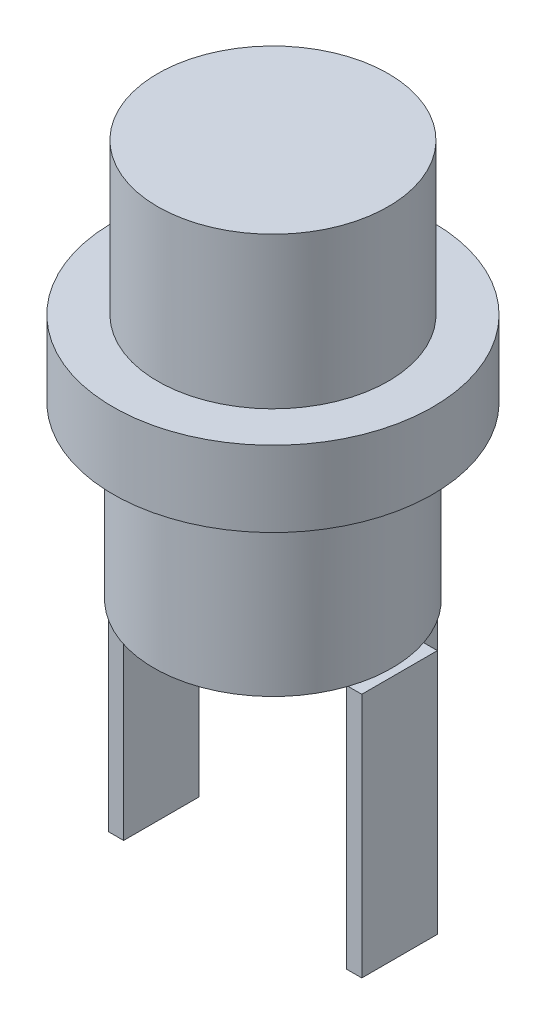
from build123d import *

# Parameters (mm, degrees)
SKETCH1_R           = 3.8735
BOSS_EXTRUDE1_DEPTH = 5.08
SKETCH2_R           = 5.3721
BOSS_EXTRUDE2_DEPTH = 2.54
SKETCH3_R           = 4.0005
BOSS_EXTRUDE3_DEPTH = 5.7404
SKETCH4_W           = 0.508
SKETCH4_H           = 2.54
SKETCH4_W_2         = 2.54
SKETCH4_H_2         = 0.508
BOSS_EXTRUDE4_DEPTH = 8.255


with BuildPart() as part:
    # Sketch1 → Boss-Extrude1 (new body)
    with BuildSketch(Plane(origin=(0, 0, 0), x_dir=(1, 0, 0), z_dir=(0, 1, 0))):
        with Locations(Location((0, 0, 0), (0, 0, 270))):
            Circle(SKETCH1_R)
    extrude(amount=BOSS_EXTRUDE1_DEPTH)

    # Sketch2 → Boss-Extrude2 (add)
    with BuildSketch(Plane.XZ):
        with Locations(Location((0, 0, 0), (0, 0, 270))):
            Circle(SKETCH2_R)
    extrude(amount=BOSS_EXTRUDE2_DEPTH)

    # Sketch3 → Boss-Extrude3 (add)
    with BuildSketch(Plane.XZ.offset(2.54)):
        with Locations(Location((0, 0, 0), (0, 0, 90))):
            Circle(SKETCH3_R)
    extrude(amount=BOSS_EXTRUDE3_DEPTH)

    # Sketch4 → Boss-Extrude4 (add)
    with BuildSketch(Plane.XZ.offset(8.2804)):
        with Locations((-4.0005, 0)):
            Rectangle(SKETCH4_W, SKETCH4_H)
        with Locations((0, -4.0005)):
            Rectangle(SKETCH4_W_2, SKETCH4_H_2)
        with Locations((4.0005, 0)):
            Rectangle(SKETCH4_W, SKETCH4_H)
    extrude(amount=BOSS_EXTRUDE4_DEPTH)


solid = part.part
